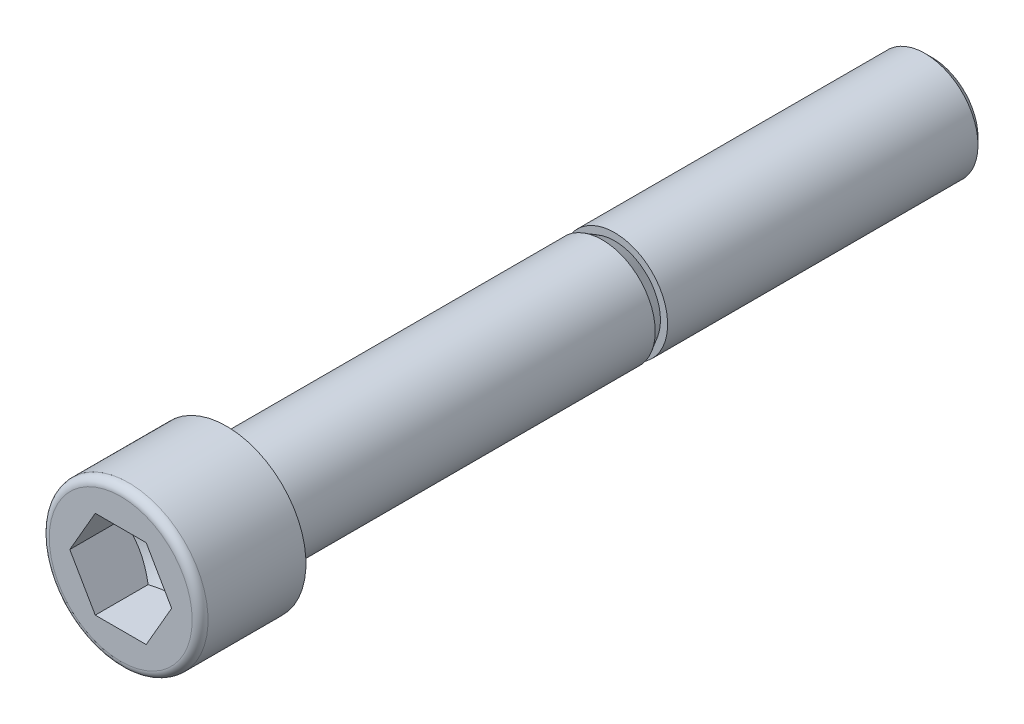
ISO-10303-21;
HEADER;
FILE_DESCRIPTION(('STEP AP214'),'2;1');
FILE_NAME('part.step','',(''),(''),'','','');
FILE_SCHEMA(('AUTOMOTIVE_DESIGN { 1 0 10303 214 1 1 1 1 }'));
ENDSEC;
DATA;
#1=APPLICATION_CONTEXT('core data for automotive mechanical design processes');
#2=APPLICATION_PROTOCOL_DEFINITION('international standard','automotive_design',2000,#1);
#3=PRODUCT_CONTEXT('',#1,'mechanical');
#4=PRODUCT('Part','Part','',(#3));
#5=PRODUCT_RELATED_PRODUCT_CATEGORY('part','',(#4));
#6=PRODUCT_DEFINITION_FORMATION('','',#4);
#7=PRODUCT_DEFINITION_CONTEXT('part definition',#1,'design');
#8=PRODUCT_DEFINITION('design','',#6,#7);
#9=PRODUCT_DEFINITION_SHAPE('','',#8);
#10=(LENGTH_UNIT() NAMED_UNIT(*) SI_UNIT(.MILLI.,.METRE.));
#11=(NAMED_UNIT(*) PLANE_ANGLE_UNIT() SI_UNIT($,.RADIAN.));
#12=(NAMED_UNIT(*) SI_UNIT($,.STERADIAN.) SOLID_ANGLE_UNIT());
#13=UNCERTAINTY_MEASURE_WITH_UNIT(LENGTH_MEASURE(1.E-05),#10,'distance_accuracy_value','');
#14=(GEOMETRIC_REPRESENTATION_CONTEXT(3) GLOBAL_UNCERTAINTY_ASSIGNED_CONTEXT((#13)) GLOBAL_UNIT_ASSIGNED_CONTEXT((#10,
#11,#12)) REPRESENTATION_CONTEXT('',''));
#15=CARTESIAN_POINT('',(0.,0.,0.));
#16=DIRECTION('',(0.,0.,1.));
#17=DIRECTION('',(1.,0.,0.));
#18=AXIS2_PLACEMENT_3D('',#15,#16,#17);
#19=CARTESIAN_POINT('',(0.,0.,6.01999999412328));
#20=DIRECTION('',(0.,0.,1.));
#21=DIRECTION('',(1.,0.,0.));
#22=AXIS2_PLACEMENT_3D('',#19,#20,#21);
#23=CONICAL_SURFACE('',#22,5.8081409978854,1.04719754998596);
#24=CARTESIAN_POINT('',(5.77350000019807,1.36206373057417E-09,6.00000000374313));
#25=CARTESIAN_POINT('',(5.64663818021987,0.21973111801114,5.92674342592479));
#26=CARTESIAN_POINT('',(5.51869130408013,0.441341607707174,5.86011402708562));
#27=CARTESIAN_POINT('',(5.26058220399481,0.888399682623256,5.74381382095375));
#28=CARTESIAN_POINT('',(5.1304153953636,1.11385520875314,5.69418415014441));
#29=CARTESIAN_POINT('',(4.87167505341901,1.56200662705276,5.61694451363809));
#30=CARTESIAN_POINT('',(4.74314180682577,1.78463274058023,5.58882002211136));
#31=CARTESIAN_POINT('',(4.54988998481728,2.11935471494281,5.56360347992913));
#32=CARTESIAN_POINT('',(4.4854286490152,2.23100502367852,5.55802493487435));
#33=CARTESIAN_POINT('',(4.35644646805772,2.45440871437,5.55261934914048));
#34=CARTESIAN_POINT('',(4.29192562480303,2.56616209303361,5.55279213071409));
#35=CARTESIAN_POINT('',(4.1151716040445,2.87230903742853,5.56117994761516));
#36=CARTESIAN_POINT('',(4.00299704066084,3.06660108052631,5.57525719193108));
#37=CARTESIAN_POINT('',(3.77939237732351,3.45389571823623,5.61988965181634));
#38=CARTESIAN_POINT('',(3.66796306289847,3.64689695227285,5.65046011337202));
#39=CARTESIAN_POINT('',(3.44390816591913,4.03497141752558,5.72687582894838));
#40=CARTESIAN_POINT('',(3.33131085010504,4.2299956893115,5.77304477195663));
#41=CARTESIAN_POINT('',(3.1077951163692,4.61713629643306,5.87782890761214));
#42=CARTESIAN_POINT('',(2.99687383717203,4.80925758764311,5.93641949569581));
#43=CARTESIAN_POINT('',(2.88675000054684,4.9999976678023,6.00000000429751));
#44=B_SPLINE_CURVE_WITH_KNOTS('',3,(#24,#25,#26,#27,#28,#29,#30,#31,#32,#33,#34,#35,#36,#37,#38,
#39,#40,#41,#42,#43),.UNSPECIFIED.,.F.,.F.,(4,2,2,2,2,2,2,2,2,4),(0.,0.792539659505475,
1.58698380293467,2.36176791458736,2.74878605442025,3.13579223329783,3.80945915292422,
4.48374986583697,5.1729931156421,5.86088367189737),.UNSPECIFIED.);
#45=CARTESIAN_POINT('',(5.77349999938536,0.,6.00000000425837));
#46=VERTEX_POINT('',#45);
#47=CARTESIAN_POINT('',(2.88674999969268,4.99999766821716,6.00000000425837));
#48=VERTEX_POINT('',#47);
#49=EDGE_CURVE('E118',#46,#48,#44,.T.);
#50=ORIENTED_EDGE('',*,*,#49,.T.);
#51=CARTESIAN_POINT('',(2.88674999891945,4.99999766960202,6.00000000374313));
#52=CARTESIAN_POINT('',(2.64977644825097,4.99999766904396,5.93158447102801));
#53=CARTESIAN_POINT('',(2.41092822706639,4.99999766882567,5.86894811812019));
#54=CARTESIAN_POINT('',(1.92935186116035,4.99999766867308,5.75824613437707));
#55=CARTESIAN_POINT('',(1.68661629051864,4.99999766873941,5.71021310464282));
#56=CARTESIAN_POINT('',(1.20386885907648,4.99999766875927,5.6329701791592));
#57=CARTESIAN_POINT('',(0.963924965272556,4.99999766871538,5.60334845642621));
#58=CARTESIAN_POINT('',(0.482652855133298,4.99999766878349,5.56358305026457));
#59=CARTESIAN_POINT('',(0.241326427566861,4.99999766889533,5.55341822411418));
#60=CARTESIAN_POINT('',(-0.241326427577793,4.99999766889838,5.55341822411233));
#61=CARTESIAN_POINT('',(-0.48265285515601,4.9999976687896,5.56358305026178));
#62=CARTESIAN_POINT('',(-0.963924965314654,4.99999766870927,5.60334845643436));
#63=CARTESIAN_POINT('',(-1.20386885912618,4.99999766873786,5.63297017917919));
#64=CARTESIAN_POINT('',(-1.68661629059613,4.99999766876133,5.7102131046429));
#65=CARTESIAN_POINT('',(-1.92935186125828,4.99999766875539,5.75824613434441));
#66=CARTESIAN_POINT('',(-2.41092822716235,4.99999766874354,5.8689481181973));
#67=CARTESIAN_POINT('',(-2.64977644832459,4.99999766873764,5.93158447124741));
#68=CARTESIAN_POINT('',(-2.88674999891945,4.99999766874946,6.0000000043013));
#69=B_SPLINE_CURVE_WITH_KNOTS('',3,(#51,#52,#53,#54,#55,#56,#57,#58,#59,#60,#61,#62,#63,#64,#65,
#66,#67,#68),.UNSPECIFIED.,.F.,.F.,(4,2,2,2,2,2,2,2,4),(0.,0.740183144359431,1.48200677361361,
2.20657611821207,2.9303576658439,3.65413921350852,4.37870855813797,5.1205321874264,
5.86071533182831),.UNSPECIFIED.);
#70=CARTESIAN_POINT('',(-2.88674999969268,4.99999766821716,6.00000000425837));
#71=VERTEX_POINT('',#70);
#72=EDGE_CURVE('E139',#48,#71,#69,.T.);
#73=ORIENTED_EDGE('',*,*,#72,.T.);
#74=CARTESIAN_POINT('',(-2.88675000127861,4.99999766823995,6.00000000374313));
#75=CARTESIAN_POINT('',(-3.01361182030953,4.78026655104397,5.92674342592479));
#76=CARTESIAN_POINT('',(-3.14155869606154,4.55865606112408,5.86011402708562));
#77=CARTESIAN_POINT('',(-3.39966779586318,4.11159798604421,5.74381382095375));
#78=CARTESIAN_POINT('',(-3.52983460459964,3.88614245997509,5.69418415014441));
#79=CARTESIAN_POINT('',(-3.78857494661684,3.43799104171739,5.61694451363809));
#80=CARTESIAN_POINT('',(-3.9171081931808,3.21536492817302,5.58882002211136));
#81=CARTESIAN_POINT('',(-4.11036001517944,2.88064295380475,5.56360347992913));
#82=CARTESIAN_POINT('',(-4.1748213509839,2.76899264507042,5.55802493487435));
#83=CARTESIAN_POINT('',(-4.30380353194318,2.54558895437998,5.55261934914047));
#84=CARTESIAN_POINT('',(-4.36832437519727,2.43383557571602,5.55279213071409));
#85=CARTESIAN_POINT('',(-4.54507839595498,2.12768863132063,5.56117994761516));
#86=CARTESIAN_POINT('',(-4.65725295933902,1.93339658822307,5.57525719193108));
#87=CARTESIAN_POINT('',(-4.88085762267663,1.54610195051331,5.61988965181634));
#88=CARTESIAN_POINT('',(-4.99228693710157,1.35310071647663,5.65046011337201));
#89=CARTESIAN_POINT('',(-5.21634183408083,0.965026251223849,5.72687582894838));
#90=CARTESIAN_POINT('',(-5.32893914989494,0.770001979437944,5.77304477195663));
#91=CARTESIAN_POINT('',(-5.55245488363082,0.382861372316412,5.87782890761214));
#92=CARTESIAN_POINT('',(-5.66337616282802,0.190740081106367,5.93641949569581));
#93=CARTESIAN_POINT('',(-5.77349999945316,9.47160257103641E-10,6.00000000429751));
#94=B_SPLINE_CURVE_WITH_KNOTS('',3,(#74,#75,#76,#77,#78,#79,#80,#81,#82,#83,#84,#85,#86,#87,#88,
#89,#90,#91,#92,#93),.UNSPECIFIED.,.F.,.F.,(4,2,2,2,2,2,2,2,2,4),(0.,0.792539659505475,
1.58698380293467,2.36176791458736,2.74878605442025,3.13579223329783,3.80945915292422,
4.48374986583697,5.1729931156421,5.86088367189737),.UNSPECIFIED.);
#95=CARTESIAN_POINT('',(-5.77349999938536,0.,6.00000000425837));
#96=VERTEX_POINT('',#95);
#97=EDGE_CURVE('E146',#71,#96,#94,.T.);
#98=ORIENTED_EDGE('',*,*,#97,.T.);
#99=CARTESIAN_POINT('',(-5.77350000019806,-1.3620611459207E-09,6.00000000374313));
#100=CARTESIAN_POINT('',(-5.64663818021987,-0.219731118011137,5.92674342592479));
#101=CARTESIAN_POINT('',(-5.51869130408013,-0.441341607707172,5.86011402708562));
#102=CARTESIAN_POINT('',(-5.26058220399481,-0.888399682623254,5.74381382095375));
#103=CARTESIAN_POINT('',(-5.1304153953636,-1.11385520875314,5.69418415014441));
#104=CARTESIAN_POINT('',(-4.87167505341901,-1.56200662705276,5.61694451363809));
#105=CARTESIAN_POINT('',(-4.74314180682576,-1.78463274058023,5.58882002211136));
#106=CARTESIAN_POINT('',(-4.54988998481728,-2.11935471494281,5.56360347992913));
#107=CARTESIAN_POINT('',(-4.4854286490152,-2.23100502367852,5.55802493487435));
#108=CARTESIAN_POINT('',(-4.35644646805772,-2.45440871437,5.55261934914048));
#109=CARTESIAN_POINT('',(-4.29192562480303,-2.56616209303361,5.55279213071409));
#110=CARTESIAN_POINT('',(-4.1151716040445,-2.87230903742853,5.56117994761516));
#111=CARTESIAN_POINT('',(-4.00299704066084,-3.06660108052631,5.57525719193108));
#112=CARTESIAN_POINT('',(-3.77939237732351,-3.45389571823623,5.61988965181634));
#113=CARTESIAN_POINT('',(-3.66796306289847,-3.64689695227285,5.65046011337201));
#114=CARTESIAN_POINT('',(-3.44390816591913,-4.03497141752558,5.72687582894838));
#115=CARTESIAN_POINT('',(-3.33131085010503,-4.2299956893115,5.77304477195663));
#116=CARTESIAN_POINT('',(-3.1077951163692,-4.61713629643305,5.87782890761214));
#117=CARTESIAN_POINT('',(-2.99687383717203,-4.80925758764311,5.93641949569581));
#118=CARTESIAN_POINT('',(-2.88675000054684,-4.99999766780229,6.00000000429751));
#119=B_SPLINE_CURVE_WITH_KNOTS('',3,(#99,#100,#101,#102,#103,#104,#105,#106,#107,#108,#109,#110,
#111,#112,#113,#114,#115,#116,#117,#118),.UNSPECIFIED.,.F.,.F.,(4,2,2,2,2,2,2,2,2,4),(0.,
0.792539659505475,1.58698380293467,2.36176791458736,2.74878605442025,3.13579223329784,
3.80945915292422,4.48374986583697,5.1729931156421,5.86088367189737),.UNSPECIFIED.);
#120=CARTESIAN_POINT('',(-2.88674999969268,-4.99999766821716,6.00000000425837));
#121=VERTEX_POINT('',#120);
#122=EDGE_CURVE('E90',#96,#121,#119,.T.);
#123=ORIENTED_EDGE('',*,*,#122,.T.);
#124=CARTESIAN_POINT('',(-2.88674999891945,-4.99999766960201,6.00000000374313));
#125=CARTESIAN_POINT('',(-2.64977644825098,-4.99999766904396,5.93158447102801));
#126=CARTESIAN_POINT('',(-2.41092822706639,-4.99999766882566,5.86894811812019));
#127=CARTESIAN_POINT('',(-1.92935186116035,-4.99999766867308,5.75824613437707));
#128=CARTESIAN_POINT('',(-1.68661629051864,-4.99999766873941,5.71021310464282));
#129=CARTESIAN_POINT('',(-1.20386885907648,-4.99999766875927,5.6329701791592));
#130=CARTESIAN_POINT('',(-0.963924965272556,-4.99999766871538,5.60334845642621));
#131=CARTESIAN_POINT('',(-0.482652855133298,-4.99999766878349,5.56358305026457));
#132=CARTESIAN_POINT('',(-0.241326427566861,-4.99999766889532,5.55341822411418));
#133=CARTESIAN_POINT('',(0.241326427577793,-4.99999766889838,5.55341822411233));
#134=CARTESIAN_POINT('',(0.48265285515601,-4.9999976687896,5.56358305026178));
#135=CARTESIAN_POINT('',(0.963924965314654,-4.99999766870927,5.60334845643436));
#136=CARTESIAN_POINT('',(1.20386885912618,-4.99999766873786,5.63297017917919));
#137=CARTESIAN_POINT('',(1.68661629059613,-4.99999766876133,5.7102131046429));
#138=CARTESIAN_POINT('',(1.92935186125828,-4.99999766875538,5.75824613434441));
#139=CARTESIAN_POINT('',(2.41092822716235,-4.99999766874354,5.8689481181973));
#140=CARTESIAN_POINT('',(2.64977644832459,-4.99999766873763,5.93158447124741));
#141=CARTESIAN_POINT('',(2.88674999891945,-4.99999766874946,6.0000000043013));
#142=B_SPLINE_CURVE_WITH_KNOTS('',3,(#124,#125,#126,#127,#128,#129,#130,#131,#132,#133,#134,
#135,#136,#137,#138,#139,#140,#141),.UNSPECIFIED.,.F.,.F.,(4,2,2,2,2,2,2,2,4),(0.,
0.740183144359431,1.48200677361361,2.20657611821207,2.93035766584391,3.65413921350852,
4.37870855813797,5.1205321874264,5.86071533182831),.UNSPECIFIED.);
#143=CARTESIAN_POINT('',(2.88674999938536,-4.99999766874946,6.0000000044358));
#144=VERTEX_POINT('',#143);
#145=EDGE_CURVE('E82',#121,#144,#142,.T.);
#146=ORIENTED_EDGE('',*,*,#145,.T.);
#147=CARTESIAN_POINT('',(2.88675000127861,-4.99999766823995,6.00000000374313));
#148=CARTESIAN_POINT('',(3.01361182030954,-4.78026655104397,5.92674342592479));
#149=CARTESIAN_POINT('',(3.14155869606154,-4.55865606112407,5.86011402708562));
#150=CARTESIAN_POINT('',(3.39966779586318,-4.11159798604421,5.74381382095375));
#151=CARTESIAN_POINT('',(3.52983460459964,-3.88614245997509,5.69418415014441));
#152=CARTESIAN_POINT('',(3.78857494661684,-3.43799104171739,5.61694451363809));
#153=CARTESIAN_POINT('',(3.9171081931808,-3.21536492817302,5.58882002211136));
#154=CARTESIAN_POINT('',(4.11036001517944,-2.88064295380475,5.56360347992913));
#155=CARTESIAN_POINT('',(4.1748213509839,-2.76899264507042,5.55802493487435));
#156=CARTESIAN_POINT('',(4.30380353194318,-2.54558895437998,5.55261934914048));
#157=CARTESIAN_POINT('',(4.36832437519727,-2.43383557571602,5.55279213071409));
#158=CARTESIAN_POINT('',(4.54507839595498,-2.12768863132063,5.56117994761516));
#159=CARTESIAN_POINT('',(4.65725295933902,-1.93339658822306,5.57525719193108));
#160=CARTESIAN_POINT('',(4.88085762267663,-1.54610195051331,5.61988965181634));
#161=CARTESIAN_POINT('',(4.99228693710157,-1.35310071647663,5.65046011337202));
#162=CARTESIAN_POINT('',(5.21634183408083,-0.965026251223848,5.72687582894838));
#163=CARTESIAN_POINT('',(5.32893914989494,-0.770001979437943,5.77304477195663));
#164=CARTESIAN_POINT('',(5.55245488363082,-0.382861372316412,5.87782890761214));
#165=CARTESIAN_POINT('',(5.66337616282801,-0.190740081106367,5.93641949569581));
#166=CARTESIAN_POINT('',(5.77349999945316,-9.47160055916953E-10,6.00000000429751));
#167=B_SPLINE_CURVE_WITH_KNOTS('',3,(#147,#148,#149,#150,#151,#152,#153,#154,#155,#156,#157,
#158,#159,#160,#161,#162,#163,#164,#165,#166),.UNSPECIFIED.,.F.,.F.,(4,2,2,2,2,2,2,2,2,4),(0.,
0.792539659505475,1.58698380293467,2.36176791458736,2.74878605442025,3.13579223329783,
3.80945915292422,4.48374986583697,5.1729931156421,5.86088367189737),.UNSPECIFIED.);
#168=EDGE_CURVE('E87',#144,#46,#167,.T.);
#169=ORIENTED_EDGE('',*,*,#168,.T.);
#170=EDGE_LOOP('',(#50,#73,#98,#123,#146,#169));
#171=FACE_BOUND('',#170,.T.);
#172=CARTESIAN_POINT('',(0.,5.6843418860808E-11,2.66666821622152));
#173=VERTEX_POINT('',#172);
#174=VERTEX_LOOP('',#173);
#175=FACE_BOUND('',#174,.T.);
#176=ADVANCED_FACE('F16',(#171,#175),#23,.F.);
#177=CARTESIAN_POINT('',(-2.88675,-4.99999766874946,12.));
#178=DIRECTION('',(0.,-1.,0.));
#179=DIRECTION('',(0.,0.,-1.));
#180=AXIS2_PLACEMENT_3D('',#177,#178,#179);
#181=PLANE('',#180);
#182=ORIENTED_EDGE('',*,*,#145,.F.);
#183=DIRECTION('',(0.,0.,1.));
#184=VECTOR('',#183,1.);
#185=CARTESIAN_POINT('',(-2.88675,-4.99999766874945,12.));
#186=LINE('',#185,#184);
#187=CARTESIAN_POINT('',(-2.88675,-4.99999766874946,12.));
#188=VERTEX_POINT('',#187);
#189=EDGE_CURVE('E93',#121,#188,#186,.T.);
#190=ORIENTED_EDGE('',*,*,#189,.T.);
#191=DIRECTION('',(1.,0.,0.));
#192=VECTOR('',#191,1.);
#193=CARTESIAN_POINT('',(0.,-4.99999766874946,12.));
#194=LINE('',#193,#192);
#195=CARTESIAN_POINT('',(2.88675,-4.99999766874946,12.));
#196=VERTEX_POINT('',#195);
#197=EDGE_CURVE('E99',#196,#188,#194,.F.);
#198=ORIENTED_EDGE('',*,*,#197,.F.);
#199=DIRECTION('',(0.,0.,1.));
#200=VECTOR('',#199,1.);
#201=CARTESIAN_POINT('',(2.88675,-4.99999766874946,12.));
#202=LINE('',#201,#200);
#203=EDGE_CURVE('E96',#196,#144,#202,.F.);
#204=ORIENTED_EDGE('',*,*,#203,.T.);
#205=EDGE_LOOP('',(#182,#190,#198,#204));
#206=FACE_BOUND('',#205,.T.);
#207=ADVANCED_FACE('F97',(#206),#181,.F.);
#208=CARTESIAN_POINT('',(-5.7735,0.,12.));
#209=DIRECTION('',(-0.866025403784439,-0.5,0.));
#210=DIRECTION('',(0.5,-0.866025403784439,0.));
#211=AXIS2_PLACEMENT_3D('',#208,#209,#210);
#212=PLANE('',#211);
#213=DIRECTION('',(0.,0.,1.));
#214=VECTOR('',#213,1.);
#215=CARTESIAN_POINT('',(-5.7735,0.,12.));
#216=LINE('',#215,#214);
#217=CARTESIAN_POINT('',(-5.7735,0.,12.));
#218=VERTEX_POINT('',#217);
#219=EDGE_CURVE('E154',#96,#218,#216,.T.);
#220=ORIENTED_EDGE('',*,*,#219,.T.);
#221=DIRECTION('',(-0.5,0.866025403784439,0.));
#222=VECTOR('',#221,1.);
#223=CARTESIAN_POINT('',(-2.88675,-4.99999766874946,12.));
#224=LINE('',#223,#222);
#225=EDGE_CURVE('E107',#188,#218,#224,.T.);
#226=ORIENTED_EDGE('',*,*,#225,.F.);
#227=ORIENTED_EDGE('',*,*,#189,.F.);
#228=ORIENTED_EDGE('',*,*,#122,.F.);
#229=EDGE_LOOP('',(#220,#226,#227,#228));
#230=FACE_BOUND('',#229,.T.);
#231=ADVANCED_FACE('F155',(#230),#212,.F.);
#232=CARTESIAN_POINT('',(-2.88675,4.99999766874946,12.));
#233=DIRECTION('',(-0.866025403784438,0.5,0.));
#234=DIRECTION('',(-0.5,-0.866025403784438,0.));
#235=AXIS2_PLACEMENT_3D('',#232,#233,#234);
#236=PLANE('',#235);
#237=DIRECTION('',(0.,0.,1.));
#238=VECTOR('',#237,1.);
#239=CARTESIAN_POINT('',(-2.88675,4.99999766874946,12.));
#240=LINE('',#239,#238);
#241=CARTESIAN_POINT('',(-2.88675,4.99999766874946,12.));
#242=VERTEX_POINT('',#241);
#243=EDGE_CURVE('E301',#71,#242,#240,.T.);
#244=ORIENTED_EDGE('',*,*,#243,.T.);
#245=DIRECTION('',(0.5,0.866025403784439,0.));
#246=VECTOR('',#245,1.);
#247=CARTESIAN_POINT('',(-5.7735,0.,12.));
#248=LINE('',#247,#246);
#249=EDGE_CURVE('E262',#218,#242,#248,.T.);
#250=ORIENTED_EDGE('',*,*,#249,.F.);
#251=ORIENTED_EDGE('',*,*,#219,.F.);
#252=ORIENTED_EDGE('',*,*,#97,.F.);
#253=EDGE_LOOP('',(#244,#250,#251,#252));
#254=FACE_BOUND('',#253,.T.);
#255=ADVANCED_FACE('F158',(#254),#236,.F.);
#256=CARTESIAN_POINT('',(2.88675,4.99999766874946,12.));
#257=DIRECTION('',(0.,1.,0.));
#258=DIRECTION('',(0.,0.,1.));
#259=AXIS2_PLACEMENT_3D('',#256,#257,#258);
#260=PLANE('',#259);
#261=ORIENTED_EDGE('',*,*,#72,.F.);
#262=DIRECTION('',(0.,0.,1.));
#263=VECTOR('',#262,1.);
#264=CARTESIAN_POINT('',(2.88675,4.99999766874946,12.));
#265=LINE('',#264,#263);
#266=CARTESIAN_POINT('',(2.88675,4.99999766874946,12.));
#267=VERTEX_POINT('',#266);
#268=EDGE_CURVE('E306',#48,#267,#265,.T.);
#269=ORIENTED_EDGE('',*,*,#268,.T.);
#270=DIRECTION('',(1.,0.,0.));
#271=VECTOR('',#270,1.);
#272=CARTESIAN_POINT('',(0.,4.99999766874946,12.));
#273=LINE('',#272,#271);
#274=EDGE_CURVE('E257',#242,#267,#273,.T.);
#275=ORIENTED_EDGE('',*,*,#274,.F.);
#276=ORIENTED_EDGE('',*,*,#243,.F.);
#277=EDGE_LOOP('',(#261,#269,#275,#276));
#278=FACE_BOUND('',#277,.T.);
#279=ADVANCED_FACE('F162',(#278),#260,.F.);
#280=CARTESIAN_POINT('',(5.7735,0.,12.));
#281=DIRECTION('',(0.866025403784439,0.5,0.));
#282=DIRECTION('',(-0.5,0.866025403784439,0.));
#283=AXIS2_PLACEMENT_3D('',#280,#281,#282);
#284=PLANE('',#283);
#285=DIRECTION('',(0.,0.,1.));
#286=VECTOR('',#285,1.);
#287=CARTESIAN_POINT('',(5.7735,0.,12.));
#288=LINE('',#287,#286);
#289=CARTESIAN_POINT('',(5.7735,0.,12.));
#290=VERTEX_POINT('',#289);
#291=EDGE_CURVE('E103',#46,#290,#288,.T.);
#292=ORIENTED_EDGE('',*,*,#291,.T.);
#293=DIRECTION('',(0.5,-0.866025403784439,0.));
#294=VECTOR('',#293,1.);
#295=CARTESIAN_POINT('',(2.88675,4.99999766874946,12.));
#296=LINE('',#295,#294);
#297=EDGE_CURVE('E252',#267,#290,#296,.T.);
#298=ORIENTED_EDGE('',*,*,#297,.F.);
#299=ORIENTED_EDGE('',*,*,#268,.F.);
#300=ORIENTED_EDGE('',*,*,#49,.F.);
#301=EDGE_LOOP('',(#292,#298,#299,#300));
#302=FACE_BOUND('',#301,.T.);
#303=ADVANCED_FACE('F166',(#302),#284,.F.);
#304=CARTESIAN_POINT('',(2.88675,-4.99999766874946,12.));
#305=DIRECTION('',(0.866025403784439,-0.5,0.));
#306=DIRECTION('',(0.5,0.866025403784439,0.));
#307=AXIS2_PLACEMENT_3D('',#304,#305,#306);
#308=PLANE('',#307);
#309=ORIENTED_EDGE('',*,*,#203,.F.);
#310=DIRECTION('',(-0.5,-0.866025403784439,0.));
#311=VECTOR('',#310,1.);
#312=CARTESIAN_POINT('',(5.7735,0.,12.));
#313=LINE('',#312,#311);
#314=EDGE_CURVE('E250',#290,#196,#313,.T.);
#315=ORIENTED_EDGE('',*,*,#314,.F.);
#316=ORIENTED_EDGE('',*,*,#291,.F.);
#317=ORIENTED_EDGE('',*,*,#168,.F.);
#318=EDGE_LOOP('',(#309,#315,#316,#317));
#319=FACE_BOUND('',#318,.T.);
#320=ADVANCED_FACE('F105',(#319),#308,.F.);
#321=CARTESIAN_POINT('',(0.,2.5940625,-80.));
#322=DIRECTION('',(0.,0.,-1.));
#323=DIRECTION('',(-1.,0.,0.));
#324=AXIS2_PLACEMENT_3D('',#321,#322,#323);
#325=PLANE('',#324);
#326=CARTESIAN_POINT('',(0.,0.,-80.000000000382));
#327=DIRECTION('',(0.,0.,1.));
#328=DIRECTION('',(1.,0.,0.));
#329=AXIS2_PLACEMENT_3D('',#326,#327,#328);
#330=CIRCLE('',#329,5.18812500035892);
#331=CARTESIAN_POINT('',(5.18812500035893,0.,-80.000000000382));
#332=VERTEX_POINT('',#331);
#333=EDGE_CURVE('E116',#332,#332,#330,.T.);
#334=ORIENTED_EDGE('',*,*,#333,.F.);
#335=EDGE_LOOP('',(#334));
#336=FACE_BOUND('',#335,.T.);
#337=ADVANCED_FACE('F174',(#336),#325,.T.);
#338=CARTESIAN_POINT('',(0.,4.05,12.));
#339=DIRECTION('',(0.,0.,1.));
#340=DIRECTION('',(1.,0.,0.));
#341=AXIS2_PLACEMENT_3D('',#338,#339,#340);
#342=PLANE('',#341);
#343=ORIENTED_EDGE('',*,*,#297,.T.);
#344=ORIENTED_EDGE('',*,*,#314,.T.);
#345=ORIENTED_EDGE('',*,*,#197,.T.);
#346=ORIENTED_EDGE('',*,*,#225,.T.);
#347=ORIENTED_EDGE('',*,*,#249,.T.);
#348=ORIENTED_EDGE('',*,*,#274,.T.);
#349=EDGE_LOOP('',(#343,#344,#345,#346,#347,#348));
#350=FACE_BOUND('',#349,.T.);
#351=CARTESIAN_POINT('',(0.,0.,12.));
#352=DIRECTION('',(0.,0.,-1.));
#353=DIRECTION('',(-1.,0.,0.));
#354=AXIS2_PLACEMENT_3D('',#351,#352,#353);
#355=CIRCLE('',#354,8.1);
#356=CARTESIAN_POINT('',(-8.1,0.,12.));
#357=VERTEX_POINT('',#356);
#358=CARTESIAN_POINT('',(0.,8.1,12.));
#359=VERTEX_POINT('',#358);
#360=EDGE_CURVE('E239',#357,#359,#355,.T.);
#361=ORIENTED_EDGE('',*,*,#360,.F.);
#362=CARTESIAN_POINT('',(0.,0.,12.));
#363=DIRECTION('',(0.,0.,-1.));
#364=DIRECTION('',(1.,0.,0.));
#365=AXIS2_PLACEMENT_3D('',#362,#363,#364);
#366=CIRCLE('',#365,8.1);
#367=CARTESIAN_POINT('',(8.1,0.,12.));
#368=VERTEX_POINT('',#367);
#369=EDGE_CURVE('E37',#368,#357,#366,.T.);
#370=ORIENTED_EDGE('',*,*,#369,.F.);
#371=CARTESIAN_POINT('',(0.,0.,12.));
#372=DIRECTION('',(0.,0.,-1.));
#373=DIRECTION('',(0.,1.,0.));
#374=AXIS2_PLACEMENT_3D('',#371,#372,#373);
#375=CIRCLE('',#374,8.1);
#376=EDGE_CURVE('E228',#359,#368,#375,.T.);
#377=ORIENTED_EDGE('',*,*,#376,.F.);
#378=EDGE_LOOP('',(#361,#370,#377));
#379=FACE_BOUND('',#378,.T.);
#380=ADVANCED_FACE('F296',(#350,#379),#342,.T.);
#381=CARTESIAN_POINT('',(0.,0.,-79.1881249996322));
#382=DIRECTION('',(0.,0.,1.));
#383=DIRECTION('',(1.,0.,0.));
#384=AXIS2_PLACEMENT_3D('',#381,#382,#383);
#385=CONICAL_SURFACE('',#384,5.99999999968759,0.785398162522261);
#386=ORIENTED_EDGE('',*,*,#333,.T.);
#387=EDGE_LOOP('',(#386));
#388=FACE_BOUND('',#387,.T.);
#389=CARTESIAN_POINT('',(0.,0.,-79.188125));
#390=DIRECTION('',(0.,0.,-1.));
#391=DIRECTION('',(-1.,0.,0.));
#392=AXIS2_PLACEMENT_3D('',#389,#390,#391);
#393=CIRCLE('',#392,6.);
#394=CARTESIAN_POINT('',(-6.,0.,-79.188125));
#395=VERTEX_POINT('',#394);
#396=EDGE_CURVE('E225',#395,#395,#393,.F.);
#397=ORIENTED_EDGE('',*,*,#396,.F.);
#398=EDGE_LOOP('',(#397));
#399=FACE_BOUND('',#398,.T.);
#400=ADVANCED_FACE('F208',(#388,#399),#385,.T.);
#401=CARTESIAN_POINT('',(0.,0.,11.1));
#402=DIRECTION('',(0.,0.,-1.));
#403=DIRECTION('',(-1.,0.,0.));
#404=AXIS2_PLACEMENT_3D('',#401,#402,#403);
#405=TOROIDAL_SURFACE('',#404,8.1,0.9);
#406=ORIENTED_EDGE('',*,*,#369,.T.);
#407=ORIENTED_EDGE('',*,*,#360,.T.);
#408=ORIENTED_EDGE('',*,*,#376,.T.);
#409=EDGE_LOOP('',(#406,#407,#408));
#410=FACE_BOUND('',#409,.T.);
#411=CARTESIAN_POINT('',(0.,0.,11.1));
#412=DIRECTION('',(0.,0.,-1.));
#413=DIRECTION('',(-1.,0.,0.));
#414=AXIS2_PLACEMENT_3D('',#411,#412,#413);
#415=CIRCLE('',#414,9.);
#416=CARTESIAN_POINT('',(-9.,0.,11.1));
#417=VERTEX_POINT('',#416);
#418=EDGE_CURVE('E221',#417,#417,#415,.T.);
#419=ORIENTED_EDGE('',*,*,#418,.F.);
#420=EDGE_LOOP('',(#419));
#421=FACE_BOUND('',#420,.T.);
#422=ADVANCED_FACE('F202',(#410,#421),#405,.T.);
#423=CARTESIAN_POINT('',(0.,0.,-61.5940625));
#424=DIRECTION('',(0.,0.,-1.));
#425=DIRECTION('',(-1.,0.,0.));
#426=AXIS2_PLACEMENT_3D('',#423,#424,#425);
#427=CYLINDRICAL_SURFACE('',#426,6.);
#428=ORIENTED_EDGE('',*,*,#396,.T.);
#429=EDGE_LOOP('',(#428));
#430=FACE_BOUND('',#429,.T.);
#431=CARTESIAN_POINT('',(0.,0.,-44.));
#432=DIRECTION('',(0.,0.,-1.));
#433=DIRECTION('',(-1.,0.,0.));
#434=AXIS2_PLACEMENT_3D('',#431,#432,#433);
#435=CIRCLE('',#434,6.);
#436=CARTESIAN_POINT('',(-6.,0.,-44.));
#437=VERTEX_POINT('',#436);
#438=EDGE_CURVE('E224',#437,#437,#435,.F.);
#439=ORIENTED_EDGE('',*,*,#438,.F.);
#440=EDGE_LOOP('',(#439));
#441=FACE_BOUND('',#440,.T.);
#442=ADVANCED_FACE('F199',(#430,#441),#427,.T.);
#443=CARTESIAN_POINT('',(0.,0.,5.55));
#444=DIRECTION('',(0.,0.,-1.));
#445=DIRECTION('',(-1.,0.,0.));
#446=AXIS2_PLACEMENT_3D('',#443,#444,#445);
#447=CYLINDRICAL_SURFACE('',#446,9.);
#448=CARTESIAN_POINT('',(0.,0.,0.));
#449=DIRECTION('',(0.,0.,-1.));
#450=DIRECTION('',(-1.,0.,0.));
#451=AXIS2_PLACEMENT_3D('',#448,#449,#450);
#452=CIRCLE('',#451,9.);
#453=CARTESIAN_POINT('',(-9.,0.,0.));
#454=VERTEX_POINT('',#453);
#455=EDGE_CURVE('E278',#454,#454,#452,.T.);
#456=ORIENTED_EDGE('',*,*,#455,.F.);
#457=EDGE_LOOP('',(#456));
#458=FACE_BOUND('',#457,.T.);
#459=ORIENTED_EDGE('',*,*,#418,.T.);
#460=EDGE_LOOP('',(#459));
#461=FACE_BOUND('',#460,.T.);
#462=ADVANCED_FACE('F195',(#458,#461),#447,.T.);
#463=CARTESIAN_POINT('',(0.,5.5940625,-44.));
#464=DIRECTION('',(0.,0.,1.));
#465=DIRECTION('',(1.,0.,0.));
#466=AXIS2_PLACEMENT_3D('',#463,#464,#465);
#467=PLANE('',#466);
#468=CARTESIAN_POINT('',(0.,0.,-44.0000000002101));
#469=DIRECTION('',(0.,0.,1.));
#470=DIRECTION('',(1.,0.,0.));
#471=AXIS2_PLACEMENT_3D('',#468,#469,#470);
#472=CIRCLE('',#471,5.18812500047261);
#473=CARTESIAN_POINT('',(5.18812500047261,0.,-44.0000000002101));
#474=VERTEX_POINT('',#473);
#475=EDGE_CURVE('E275',#474,#474,#472,.T.);
#476=ORIENTED_EDGE('',*,*,#475,.F.);
#477=EDGE_LOOP('',(#476));
#478=FACE_BOUND('',#477,.T.);
#479=ORIENTED_EDGE('',*,*,#438,.T.);
#480=EDGE_LOOP('',(#479));
#481=FACE_BOUND('',#480,.T.);
#482=ADVANCED_FACE('F191',(#478,#481),#467,.T.);
#483=CARTESIAN_POINT('',(0.,7.8,0.));
#484=DIRECTION('',(0.,0.,-1.));
#485=DIRECTION('',(-1.,0.,0.));
#486=AXIS2_PLACEMENT_3D('',#483,#484,#485);
#487=PLANE('',#486);
#488=CARTESIAN_POINT('',(0.,0.,0.));
#489=DIRECTION('',(0.,0.,-1.));
#490=DIRECTION('',(0.,1.,0.));
#491=AXIS2_PLACEMENT_3D('',#488,#489,#490);
#492=CIRCLE('',#491,6.6);
#493=CARTESIAN_POINT('',(0.,6.6,0.));
#494=VERTEX_POINT('',#493);
#495=EDGE_CURVE('E220',#494,#494,#492,.T.);
#496=ORIENTED_EDGE('',*,*,#495,.F.);
#497=EDGE_LOOP('',(#496));
#498=FACE_BOUND('',#497,.T.);
#499=ORIENTED_EDGE('',*,*,#455,.T.);
#500=EDGE_LOOP('',(#499));
#501=FACE_BOUND('',#500,.T.);
#502=ADVANCED_FACE('F187',(#498,#501),#487,.T.);
#503=CARTESIAN_POINT('',(0.,0.,-42.5937912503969));
#504=DIRECTION('',(0.,0.,1.));
#505=DIRECTION('',(1.,0.,0.));
#506=AXIS2_PLACEMENT_3D('',#503,#504,#505);
#507=CONICAL_SURFACE('',#506,5.9999999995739,0.523598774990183);
#508=ORIENTED_EDGE('',*,*,#475,.T.);
#509=EDGE_LOOP('',(#508));
#510=FACE_BOUND('',#509,.T.);
#511=CARTESIAN_POINT('',(0.,0.,-42.593791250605));
#512=DIRECTION('',(0.,0.,-1.));
#513=DIRECTION('',(-1.,0.,0.));
#514=AXIS2_PLACEMENT_3D('',#511,#512,#513);
#515=CIRCLE('',#514,6.);
#516=CARTESIAN_POINT('',(-6.,0.,-42.593791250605));
#517=VERTEX_POINT('',#516);
#518=EDGE_CURVE('E28',#517,#517,#515,.F.);
#519=ORIENTED_EDGE('',*,*,#518,.F.);
#520=EDGE_LOOP('',(#519));
#521=FACE_BOUND('',#520,.T.);
#522=ADVANCED_FACE('F180',(#510,#521),#507,.T.);
#523=CARTESIAN_POINT('',(0.,0.,-0.599999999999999));
#524=DIRECTION('',(0.,0.,-1.));
#525=DIRECTION('',(0.,1.,0.));
#526=AXIS2_PLACEMENT_3D('',#523,#524,#525);
#527=TOROIDAL_SURFACE('',#526,6.6,0.6);
#528=CARTESIAN_POINT('',(0.,0.,-0.6));
#529=DIRECTION('',(0.,0.,-1.));
#530=DIRECTION('',(-1.,0.,0.));
#531=AXIS2_PLACEMENT_3D('',#528,#529,#530);
#532=CIRCLE('',#531,6.);
#533=CARTESIAN_POINT('',(-6.,0.,-0.6));
#534=VERTEX_POINT('',#533);
#535=EDGE_CURVE('E10',#534,#534,#532,.T.);
#536=ORIENTED_EDGE('',*,*,#535,.F.);
#537=EDGE_LOOP('',(#536));
#538=FACE_BOUND('',#537,.T.);
#539=ORIENTED_EDGE('',*,*,#495,.T.);
#540=EDGE_LOOP('',(#539));
#541=FACE_BOUND('',#540,.T.);
#542=ADVANCED_FACE('F18',(#538,#541),#527,.F.);
#543=CARTESIAN_POINT('',(0.,0.,-21.5968956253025));
#544=DIRECTION('',(0.,0.,-1.));
#545=DIRECTION('',(-1.,0.,0.));
#546=AXIS2_PLACEMENT_3D('',#543,#544,#545);
#547=CYLINDRICAL_SURFACE('',#546,6.);
#548=ORIENTED_EDGE('',*,*,#518,.T.);
#549=EDGE_LOOP('',(#548));
#550=FACE_BOUND('',#549,.T.);
#551=ORIENTED_EDGE('',*,*,#535,.T.);
#552=EDGE_LOOP('',(#551));
#553=FACE_BOUND('',#552,.T.);
#554=ADVANCED_FACE('F175',(#550,#553),#547,.T.);
#555=CLOSED_SHELL('',(#176,#207,#231,#255,#279,#303,#320,#337,#380,#400,#422,#442,#462,#482,
#502,#522,#542,#554));
#556=MANIFOLD_SOLID_BREP('B1',#555);
#557=ADVANCED_BREP_SHAPE_REPRESENTATION('',(#18,#556),#14);
#558=SHAPE_DEFINITION_REPRESENTATION(#9,#557);
ENDSEC;
END-ISO-10303-21;
